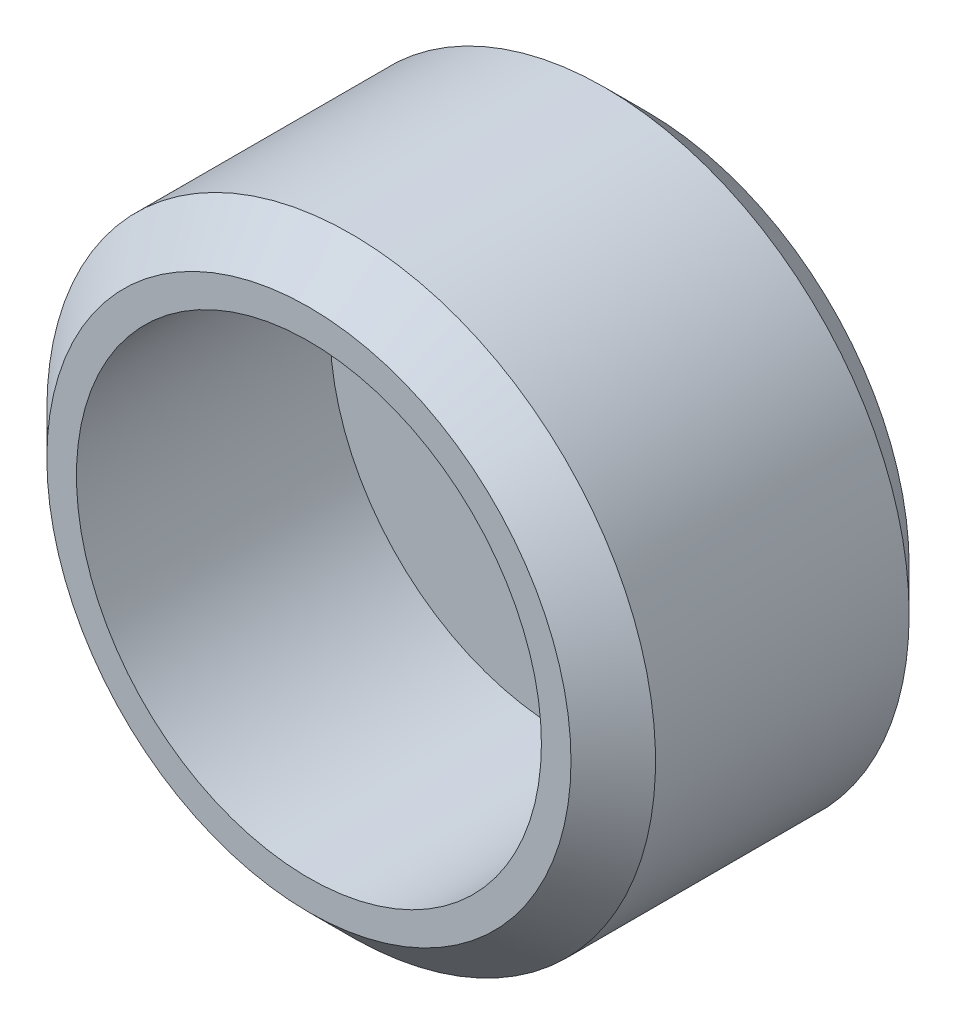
ISO-10303-21;
HEADER;
FILE_DESCRIPTION(('STEP AP214'),'2;1');
FILE_NAME('part.step','',(''),(''),'','','');
FILE_SCHEMA(('AUTOMOTIVE_DESIGN { 1 0 10303 214 1 1 1 1 }'));
ENDSEC;
DATA;
#1=APPLICATION_CONTEXT('core data for automotive mechanical design processes');
#2=APPLICATION_PROTOCOL_DEFINITION('international standard','automotive_design',2000,#1);
#3=PRODUCT_CONTEXT('',#1,'mechanical');
#4=PRODUCT('Part','Part','',(#3));
#5=PRODUCT_RELATED_PRODUCT_CATEGORY('part','',(#4));
#6=PRODUCT_DEFINITION_FORMATION('','',#4);
#7=PRODUCT_DEFINITION_CONTEXT('part definition',#1,'design');
#8=PRODUCT_DEFINITION('design','',#6,#7);
#9=PRODUCT_DEFINITION_SHAPE('','',#8);
#10=(LENGTH_UNIT() NAMED_UNIT(*) SI_UNIT(.MILLI.,.METRE.));
#11=(NAMED_UNIT(*) PLANE_ANGLE_UNIT() SI_UNIT($,.RADIAN.));
#12=(NAMED_UNIT(*) SI_UNIT($,.STERADIAN.) SOLID_ANGLE_UNIT());
#13=UNCERTAINTY_MEASURE_WITH_UNIT(LENGTH_MEASURE(1.E-05),#10,'distance_accuracy_value','');
#14=(GEOMETRIC_REPRESENTATION_CONTEXT(3) GLOBAL_UNCERTAINTY_ASSIGNED_CONTEXT((#13)) GLOBAL_UNIT_ASSIGNED_CONTEXT((#10,
#11,#12)) REPRESENTATION_CONTEXT('',''));
#15=CARTESIAN_POINT('',(0.,0.,0.));
#16=DIRECTION('',(0.,0.,1.));
#17=DIRECTION('',(1.,0.,0.));
#18=AXIS2_PLACEMENT_3D('',#15,#16,#17);
#19=CARTESIAN_POINT('',(5.25000000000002,8.75000000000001,1.));
#20=DIRECTION('',(0.,0.,1.));
#21=DIRECTION('',(1.,0.,0.));
#22=AXIS2_PLACEMENT_3D('',#19,#20,#21);
#23=PLANE('',#22);
#24=CARTESIAN_POINT('',(5.25000000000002,8.75000000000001,1.));
#25=DIRECTION('',(0.,0.,1.));
#26=DIRECTION('',(1.,0.,0.));
#27=AXIS2_PLACEMENT_3D('',#24,#25,#26);
#28=CIRCLE('',#27,2.75);
#29=CARTESIAN_POINT('',(8.00000000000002,8.75000000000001,1.));
#30=VERTEX_POINT('',#29);
#31=EDGE_CURVE('E17',#30,#30,#28,.T.);
#32=ORIENTED_EDGE('',*,*,#31,.T.);
#33=EDGE_LOOP('',(#32));
#34=FACE_BOUND('',#33,.T.);
#35=ADVANCED_FACE('F14',(#34),#23,.T.);
#36=CARTESIAN_POINT('',(5.25000000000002,8.75000000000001,1.));
#37=DIRECTION('',(0.,0.,1.));
#38=DIRECTION('',(1.,0.,0.));
#39=AXIS2_PLACEMENT_3D('',#36,#37,#38);
#40=CYLINDRICAL_SURFACE('',#39,2.75);
#41=CARTESIAN_POINT('',(5.25000000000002,8.75000000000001,4.));
#42=DIRECTION('',(0.,0.,1.));
#43=DIRECTION('',(1.,0.,0.));
#44=AXIS2_PLACEMENT_3D('',#41,#42,#43);
#45=CIRCLE('',#44,2.75);
#46=CARTESIAN_POINT('',(8.00000000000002,8.75000000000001,4.));
#47=VERTEX_POINT('',#46);
#48=EDGE_CURVE('E42',#47,#47,#45,.F.);
#49=ORIENTED_EDGE('',*,*,#48,.F.);
#50=EDGE_LOOP('',(#49));
#51=FACE_BOUND('',#50,.T.);
#52=ORIENTED_EDGE('',*,*,#31,.F.);
#53=EDGE_LOOP('',(#52));
#54=FACE_BOUND('',#53,.T.);
#55=ADVANCED_FACE('F52',(#51,#54),#40,.F.);
#56=CARTESIAN_POINT('',(5.25000000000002,8.75000000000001,0.));
#57=DIRECTION('',(0.,0.,1.));
#58=DIRECTION('',(1.,0.,0.));
#59=AXIS2_PLACEMENT_3D('',#56,#57,#58);
#60=PLANE('',#59);
#61=CARTESIAN_POINT('',(5.25000000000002,8.75000000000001,-5.6843418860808E-11));
#62=DIRECTION('',(0.,0.,1.));
#63=DIRECTION('',(1.,0.,0.));
#64=AXIS2_PLACEMENT_3D('',#61,#62,#63);
#65=CIRCLE('',#64,3.09999999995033);
#66=CARTESIAN_POINT('',(8.34999999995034,8.75000000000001,-5.6843418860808E-11));
#67=VERTEX_POINT('',#66);
#68=EDGE_CURVE('E40',#67,#67,#65,.T.);
#69=ORIENTED_EDGE('',*,*,#68,.F.);
#70=EDGE_LOOP('',(#69));
#71=FACE_BOUND('',#70,.T.);
#72=ADVANCED_FACE('F54',(#71),#60,.F.);
#73=CARTESIAN_POINT('',(5.25000000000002,8.75000000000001,4.));
#74=DIRECTION('',(0.,0.,1.));
#75=DIRECTION('',(1.,0.,0.));
#76=AXIS2_PLACEMENT_3D('',#73,#74,#75);
#77=PLANE('',#76);
#78=ORIENTED_EDGE('',*,*,#48,.T.);
#79=EDGE_LOOP('',(#78));
#80=FACE_BOUND('',#79,.T.);
#81=CARTESIAN_POINT('',(5.25000000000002,8.75000000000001,3.99999999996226));
#82=DIRECTION('',(0.,0.,-1.));
#83=DIRECTION('',(-1.,0.,0.));
#84=AXIS2_PLACEMENT_3D('',#81,#82,#83);
#85=CIRCLE('',#84,3.10000000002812);
#86=CARTESIAN_POINT('',(2.1499999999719,8.75000000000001,3.99999999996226));
#87=VERTEX_POINT('',#86);
#88=EDGE_CURVE('E30',#87,#87,#85,.T.);
#89=ORIENTED_EDGE('',*,*,#88,.F.);
#90=EDGE_LOOP('',(#89));
#91=FACE_BOUND('',#90,.T.);
#92=ADVANCED_FACE('F60',(#80,#91),#77,.T.);
#93=CARTESIAN_POINT('',(5.25000000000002,8.75000000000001,0.499999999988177));
#94=DIRECTION('',(0.,0.,1.));
#95=DIRECTION('',(1.,0.,0.));
#96=AXIS2_PLACEMENT_3D('',#93,#94,#95);
#97=CONICAL_SURFACE('',#96,3.59999999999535,0.785398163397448);
#98=CARTESIAN_POINT('',(5.25000000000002,8.75000000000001,0.500000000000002));
#99=DIRECTION('',(0.,0.,-1.));
#100=DIRECTION('',(-1.,0.,0.));
#101=AXIS2_PLACEMENT_3D('',#98,#99,#100);
#102=CIRCLE('',#101,3.6);
#103=CARTESIAN_POINT('',(1.65000000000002,8.75000000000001,0.500000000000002));
#104=VERTEX_POINT('',#103);
#105=EDGE_CURVE('E22',#104,#104,#102,.F.);
#106=ORIENTED_EDGE('',*,*,#105,.F.);
#107=EDGE_LOOP('',(#106));
#108=FACE_BOUND('',#107,.T.);
#109=ORIENTED_EDGE('',*,*,#68,.T.);
#110=EDGE_LOOP('',(#109));
#111=FACE_BOUND('',#110,.T.);
#112=ADVANCED_FACE('F70',(#108,#111),#97,.T.);
#113=CARTESIAN_POINT('',(5.25000000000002,8.75000000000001,3.50000000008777));
#114=DIRECTION('',(0.,0.,-1.));
#115=DIRECTION('',(-1.,0.,0.));
#116=AXIS2_PLACEMENT_3D('',#113,#114,#115);
#117=CONICAL_SURFACE('',#116,3.59999999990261,0.785398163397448);
#118=ORIENTED_EDGE('',*,*,#88,.T.);
#119=EDGE_LOOP('',(#118));
#120=FACE_BOUND('',#119,.T.);
#121=CARTESIAN_POINT('',(5.25000000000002,8.75000000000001,3.49999999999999));
#122=DIRECTION('',(0.,0.,-1.));
#123=DIRECTION('',(-1.,0.,0.));
#124=AXIS2_PLACEMENT_3D('',#121,#122,#123);
#125=CIRCLE('',#124,3.6);
#126=CARTESIAN_POINT('',(1.65000000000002,8.75000000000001,3.49999999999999));
#127=VERTEX_POINT('',#126);
#128=EDGE_CURVE('E10',#127,#127,#125,.T.);
#129=ORIENTED_EDGE('',*,*,#128,.F.);
#130=EDGE_LOOP('',(#129));
#131=FACE_BOUND('',#130,.T.);
#132=ADVANCED_FACE('F66',(#120,#131),#117,.T.);
#133=CARTESIAN_POINT('',(5.25000000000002,8.75000000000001,4.));
#134=DIRECTION('',(0.,0.,-1.));
#135=DIRECTION('',(-1.,0.,0.));
#136=AXIS2_PLACEMENT_3D('',#133,#134,#135);
#137=CYLINDRICAL_SURFACE('',#136,3.6);
#138=ORIENTED_EDGE('',*,*,#128,.T.);
#139=EDGE_LOOP('',(#138));
#140=FACE_BOUND('',#139,.T.);
#141=ORIENTED_EDGE('',*,*,#105,.T.);
#142=EDGE_LOOP('',(#141));
#143=FACE_BOUND('',#142,.T.);
#144=ADVANCED_FACE('F64',(#140,#143),#137,.T.);
#145=CLOSED_SHELL('',(#35,#55,#72,#92,#112,#132,#144));
#146=MANIFOLD_SOLID_BREP('B1',#145);
#147=ADVANCED_BREP_SHAPE_REPRESENTATION('',(#18,#146),#14);
#148=SHAPE_DEFINITION_REPRESENTATION(#9,#147);
ENDSEC;
END-ISO-10303-21;
